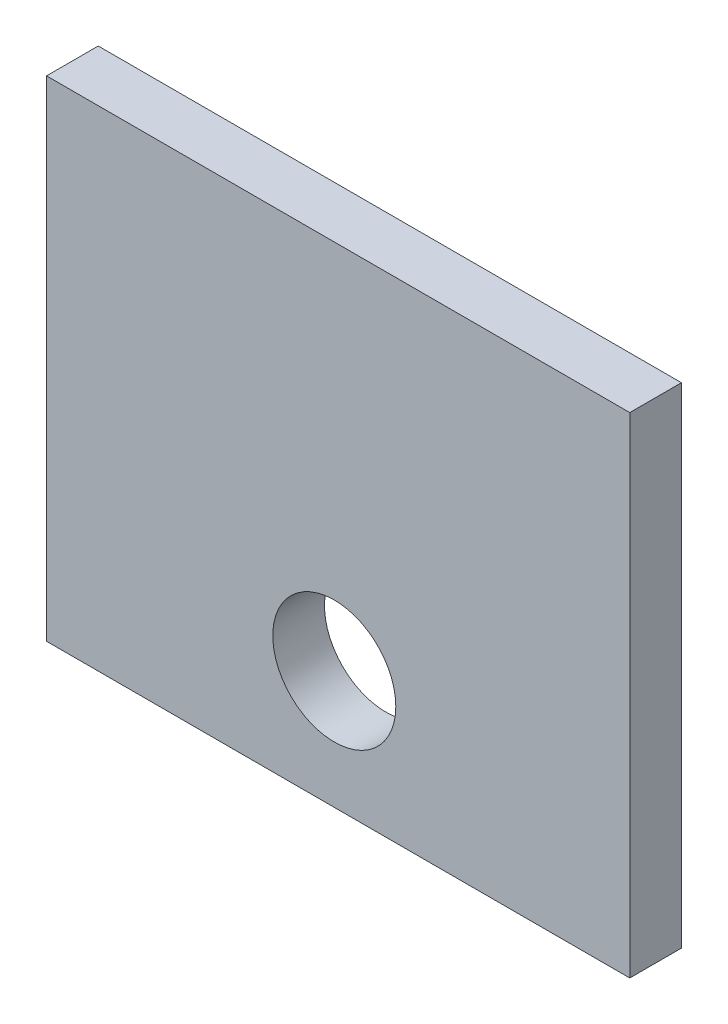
ISO-10303-21;
HEADER;
FILE_DESCRIPTION(('STEP AP214'),'2;1');
FILE_NAME('part.step','',(''),(''),'','','');
FILE_SCHEMA(('AUTOMOTIVE_DESIGN { 1 0 10303 214 1 1 1 1 }'));
ENDSEC;
DATA;
#1=APPLICATION_CONTEXT('core data for automotive mechanical design processes');
#2=APPLICATION_PROTOCOL_DEFINITION('international standard','automotive_design',2000,#1);
#3=PRODUCT_CONTEXT('',#1,'mechanical');
#4=PRODUCT('Part','Part','',(#3));
#5=PRODUCT_RELATED_PRODUCT_CATEGORY('part','',(#4));
#6=PRODUCT_DEFINITION_FORMATION('','',#4);
#7=PRODUCT_DEFINITION_CONTEXT('part definition',#1,'design');
#8=PRODUCT_DEFINITION('design','',#6,#7);
#9=PRODUCT_DEFINITION_SHAPE('','',#8);
#10=(LENGTH_UNIT() NAMED_UNIT(*) SI_UNIT(.MILLI.,.METRE.));
#11=(NAMED_UNIT(*) PLANE_ANGLE_UNIT() SI_UNIT($,.RADIAN.));
#12=(NAMED_UNIT(*) SI_UNIT($,.STERADIAN.) SOLID_ANGLE_UNIT());
#13=UNCERTAINTY_MEASURE_WITH_UNIT(LENGTH_MEASURE(1.E-05),#10,'distance_accuracy_value','');
#14=(GEOMETRIC_REPRESENTATION_CONTEXT(3) GLOBAL_UNCERTAINTY_ASSIGNED_CONTEXT((#13)) GLOBAL_UNIT_ASSIGNED_CONTEXT((#10,
#11,#12)) REPRESENTATION_CONTEXT('',''));
#15=CARTESIAN_POINT('',(0.,0.,0.));
#16=DIRECTION('',(0.,0.,1.));
#17=DIRECTION('',(1.,0.,0.));
#18=AXIS2_PLACEMENT_3D('',#15,#16,#17);
#19=CARTESIAN_POINT('',(0.,0.,5.));
#20=DIRECTION('',(0.,0.,-1.));
#21=DIRECTION('',(-1.,0.,0.));
#22=AXIS2_PLACEMENT_3D('',#19,#20,#21);
#23=PLANE('',#22);
#24=DIRECTION('',(0.,1.,0.));
#25=VECTOR('',#24,1.);
#26=CARTESIAN_POINT('',(20.0260089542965,27.6431370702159,5.));
#27=LINE('',#26,#25);
#28=CARTESIAN_POINT('',(20.0260089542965,-19.7169310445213,5.));
#29=VERTEX_POINT('',#28);
#30=CARTESIAN_POINT('',(20.0260089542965,27.6431370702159,5.));
#31=VERTEX_POINT('',#30);
#32=EDGE_CURVE('E85',#29,#31,#27,.T.);
#33=ORIENTED_EDGE('',*,*,#32,.T.);
#34=DIRECTION('',(-1.,0.,0.));
#35=VECTOR('',#34,1.);
#36=CARTESIAN_POINT('',(-36.3799844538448,27.6431370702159,5.));
#37=LINE('',#36,#35);
#38=CARTESIAN_POINT('',(-36.3799844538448,27.6431370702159,5.));
#39=VERTEX_POINT('',#38);
#40=EDGE_CURVE('E80',#31,#39,#37,.T.);
#41=ORIENTED_EDGE('',*,*,#40,.T.);
#42=DIRECTION('',(0.,-1.,0.));
#43=VECTOR('',#42,1.);
#44=CARTESIAN_POINT('',(-36.3799844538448,-19.7169310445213,5.));
#45=LINE('',#44,#43);
#46=CARTESIAN_POINT('',(-36.3799844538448,-19.7169310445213,5.));
#47=VERTEX_POINT('',#46);
#48=EDGE_CURVE('E83',#39,#47,#45,.T.);
#49=ORIENTED_EDGE('',*,*,#48,.T.);
#50=DIRECTION('',(1.,0.,0.));
#51=VECTOR('',#50,1.);
#52=CARTESIAN_POINT('',(20.0260089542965,-19.7169310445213,5.));
#53=LINE('',#52,#51);
#54=EDGE_CURVE('E50',#47,#29,#53,.T.);
#55=ORIENTED_EDGE('',*,*,#54,.T.);
#56=EDGE_LOOP('',(#33,#41,#49,#55));
#57=FACE_BOUND('',#56,.T.);
#58=CARTESIAN_POINT('',(-8.55031060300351,-8.29240705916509,5.));
#59=DIRECTION('',(0.,0.,1.));
#60=DIRECTION('',(1.,0.,0.));
#61=AXIS2_PLACEMENT_3D('',#58,#59,#60);
#62=CIRCLE('',#61,5.95);
#63=CARTESIAN_POINT('',(-2.60031060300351,-8.29240705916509,5.));
#64=VERTEX_POINT('',#63);
#65=EDGE_CURVE('E100',#64,#64,#62,.T.);
#66=ORIENTED_EDGE('',*,*,#65,.F.);
#67=EDGE_LOOP('',(#66));
#68=FACE_BOUND('',#67,.T.);
#69=ADVANCED_FACE('F33',(#57,#68),#23,.F.);
#70=CARTESIAN_POINT('',(0.,0.,0.));
#71=DIRECTION('',(0.,0.,-1.));
#72=DIRECTION('',(-1.,0.,0.));
#73=AXIS2_PLACEMENT_3D('',#70,#71,#72);
#74=PLANE('',#73);
#75=DIRECTION('',(0.,1.,0.));
#76=VECTOR('',#75,1.);
#77=CARTESIAN_POINT('',(20.0260089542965,27.6431370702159,0.));
#78=LINE('',#77,#76);
#79=CARTESIAN_POINT('',(20.0260089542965,-19.7169310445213,0.));
#80=VERTEX_POINT('',#79);
#81=CARTESIAN_POINT('',(20.0260089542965,27.6431370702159,0.));
#82=VERTEX_POINT('',#81);
#83=EDGE_CURVE('E97',#80,#82,#78,.T.);
#84=ORIENTED_EDGE('',*,*,#83,.F.);
#85=DIRECTION('',(1.,0.,0.));
#86=VECTOR('',#85,1.);
#87=CARTESIAN_POINT('',(20.0260089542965,-19.7169310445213,0.));
#88=LINE('',#87,#86);
#89=CARTESIAN_POINT('',(-36.3799844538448,-19.7169310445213,0.));
#90=VERTEX_POINT('',#89);
#91=EDGE_CURVE('E73',#90,#80,#88,.T.);
#92=ORIENTED_EDGE('',*,*,#91,.F.);
#93=DIRECTION('',(0.,-1.,0.));
#94=VECTOR('',#93,1.);
#95=CARTESIAN_POINT('',(-36.3799844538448,-19.7169310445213,0.));
#96=LINE('',#95,#94);
#97=CARTESIAN_POINT('',(-36.3799844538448,27.6431370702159,0.));
#98=VERTEX_POINT('',#97);
#99=EDGE_CURVE('E67',#98,#90,#96,.T.);
#100=ORIENTED_EDGE('',*,*,#99,.F.);
#101=DIRECTION('',(-1.,0.,0.));
#102=VECTOR('',#101,1.);
#103=CARTESIAN_POINT('',(-36.3799844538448,27.6431370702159,0.));
#104=LINE('',#103,#102);
#105=EDGE_CURVE('E89',#82,#98,#104,.T.);
#106=ORIENTED_EDGE('',*,*,#105,.F.);
#107=EDGE_LOOP('',(#84,#92,#100,#106));
#108=FACE_BOUND('',#107,.T.);
#109=CARTESIAN_POINT('',(-8.55031060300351,-8.29240705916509,0.));
#110=DIRECTION('',(0.,0.,1.));
#111=DIRECTION('',(1.,0.,0.));
#112=AXIS2_PLACEMENT_3D('',#109,#110,#111);
#113=CIRCLE('',#112,5.95);
#114=CARTESIAN_POINT('',(-2.60031060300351,-8.29240705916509,0.));
#115=VERTEX_POINT('',#114);
#116=EDGE_CURVE('E112',#115,#115,#113,.T.);
#117=ORIENTED_EDGE('',*,*,#116,.T.);
#118=EDGE_LOOP('',(#117));
#119=FACE_BOUND('',#118,.T.);
#120=ADVANCED_FACE('F108',(#108,#119),#74,.T.);
#121=CARTESIAN_POINT('',(20.0260089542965,27.6431370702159,5.));
#122=DIRECTION('',(-1.,0.,0.));
#123=DIRECTION('',(0.,0.,1.));
#124=AXIS2_PLACEMENT_3D('',#121,#122,#123);
#125=PLANE('',#124);
#126=ORIENTED_EDGE('',*,*,#83,.T.);
#127=DIRECTION('',(0.,0.,-1.));
#128=VECTOR('',#127,1.);
#129=CARTESIAN_POINT('',(20.0260089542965,27.6431370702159,5.));
#130=LINE('',#129,#128);
#131=EDGE_CURVE('E11',#31,#82,#130,.T.);
#132=ORIENTED_EDGE('',*,*,#131,.F.);
#133=ORIENTED_EDGE('',*,*,#32,.F.);
#134=DIRECTION('',(0.,0.,-1.));
#135=VECTOR('',#134,1.);
#136=CARTESIAN_POINT('',(20.0260089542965,-19.7169310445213,5.));
#137=LINE('',#136,#135);
#138=EDGE_CURVE('E93',#29,#80,#137,.T.);
#139=ORIENTED_EDGE('',*,*,#138,.T.);
#140=EDGE_LOOP('',(#126,#132,#133,#139));
#141=FACE_BOUND('',#140,.T.);
#142=ADVANCED_FACE('F35',(#141),#125,.F.);
#143=CARTESIAN_POINT('',(-36.3799844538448,27.6431370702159,5.));
#144=DIRECTION('',(0.,-1.,0.));
#145=DIRECTION('',(0.,0.,-1.));
#146=AXIS2_PLACEMENT_3D('',#143,#144,#145);
#147=PLANE('',#146);
#148=ORIENTED_EDGE('',*,*,#105,.T.);
#149=DIRECTION('',(0.,0.,-1.));
#150=VECTOR('',#149,1.);
#151=CARTESIAN_POINT('',(-36.3799844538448,27.6431370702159,5.));
#152=LINE('',#151,#150);
#153=EDGE_CURVE('E42',#39,#98,#152,.T.);
#154=ORIENTED_EDGE('',*,*,#153,.F.);
#155=ORIENTED_EDGE('',*,*,#40,.F.);
#156=ORIENTED_EDGE('',*,*,#131,.T.);
#157=EDGE_LOOP('',(#148,#154,#155,#156));
#158=FACE_BOUND('',#157,.T.);
#159=ADVANCED_FACE('F88',(#158),#147,.F.);
#160=CARTESIAN_POINT('',(-36.3799844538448,-19.7169310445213,5.));
#161=DIRECTION('',(1.,0.,0.));
#162=DIRECTION('',(0.,0.,-1.));
#163=AXIS2_PLACEMENT_3D('',#160,#161,#162);
#164=PLANE('',#163);
#165=ORIENTED_EDGE('',*,*,#99,.T.);
#166=DIRECTION('',(0.,0.,-1.));
#167=VECTOR('',#166,1.);
#168=CARTESIAN_POINT('',(-36.3799844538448,-19.7169310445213,5.));
#169=LINE('',#168,#167);
#170=EDGE_CURVE('E90',#47,#90,#169,.T.);
#171=ORIENTED_EDGE('',*,*,#170,.F.);
#172=ORIENTED_EDGE('',*,*,#48,.F.);
#173=ORIENTED_EDGE('',*,*,#153,.T.);
#174=EDGE_LOOP('',(#165,#171,#172,#173));
#175=FACE_BOUND('',#174,.T.);
#176=ADVANCED_FACE('F91',(#175),#164,.F.);
#177=CARTESIAN_POINT('',(20.0260089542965,-19.7169310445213,5.));
#178=DIRECTION('',(0.,1.,0.));
#179=DIRECTION('',(0.,0.,1.));
#180=AXIS2_PLACEMENT_3D('',#177,#178,#179);
#181=PLANE('',#180);
#182=ORIENTED_EDGE('',*,*,#91,.T.);
#183=ORIENTED_EDGE('',*,*,#138,.F.);
#184=ORIENTED_EDGE('',*,*,#54,.F.);
#185=ORIENTED_EDGE('',*,*,#170,.T.);
#186=EDGE_LOOP('',(#182,#183,#184,#185));
#187=FACE_BOUND('',#186,.T.);
#188=ADVANCED_FACE('F105',(#187),#181,.F.);
#189=CARTESIAN_POINT('',(-8.55031060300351,-8.29240705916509,5.));
#190=DIRECTION('',(0.,0.,-1.));
#191=DIRECTION('',(-1.,0.,0.));
#192=AXIS2_PLACEMENT_3D('',#189,#190,#191);
#193=CYLINDRICAL_SURFACE('',#192,5.95);
#194=ORIENTED_EDGE('',*,*,#65,.T.);
#195=EDGE_LOOP('',(#194));
#196=FACE_BOUND('',#195,.T.);
#197=ORIENTED_EDGE('',*,*,#116,.F.);
#198=EDGE_LOOP('',(#197));
#199=FACE_BOUND('',#198,.T.);
#200=ADVANCED_FACE('F118',(#196,#199),#193,.F.);
#201=CLOSED_SHELL('',(#69,#120,#142,#159,#176,#188,#200));
#202=MANIFOLD_SOLID_BREP('B2',#201);
#203=ADVANCED_BREP_SHAPE_REPRESENTATION('',(#18,#202),#14);
#204=SHAPE_DEFINITION_REPRESENTATION(#9,#203);
ENDSEC;
END-ISO-10303-21;
